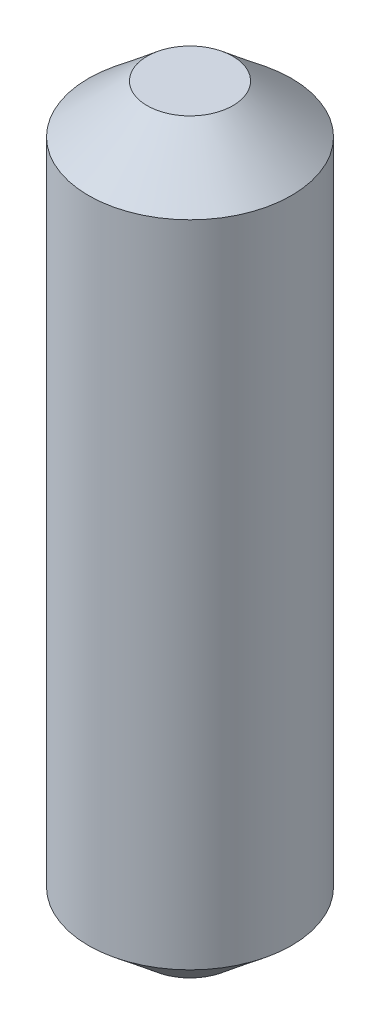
ISO-10303-21;
HEADER;
FILE_DESCRIPTION(('STEP AP214'),'2;1');
FILE_NAME('part.step','',(''),(''),'','','');
FILE_SCHEMA(('AUTOMOTIVE_DESIGN { 1 0 10303 214 1 1 1 1 }'));
ENDSEC;
DATA;
#1=APPLICATION_CONTEXT('core data for automotive mechanical design processes');
#2=APPLICATION_PROTOCOL_DEFINITION('international standard','automotive_design',2000,#1);
#3=PRODUCT_CONTEXT('',#1,'mechanical');
#4=PRODUCT('Part','Part','',(#3));
#5=PRODUCT_RELATED_PRODUCT_CATEGORY('part','',(#4));
#6=PRODUCT_DEFINITION_FORMATION('','',#4);
#7=PRODUCT_DEFINITION_CONTEXT('part definition',#1,'design');
#8=PRODUCT_DEFINITION('design','',#6,#7);
#9=PRODUCT_DEFINITION_SHAPE('','',#8);
#10=(LENGTH_UNIT() NAMED_UNIT(*) SI_UNIT(.MILLI.,.METRE.));
#11=(NAMED_UNIT(*) PLANE_ANGLE_UNIT() SI_UNIT($,.RADIAN.));
#12=(NAMED_UNIT(*) SI_UNIT($,.STERADIAN.) SOLID_ANGLE_UNIT());
#13=UNCERTAINTY_MEASURE_WITH_UNIT(LENGTH_MEASURE(1.E-05),#10,'distance_accuracy_value','');
#14=(GEOMETRIC_REPRESENTATION_CONTEXT(3) GLOBAL_UNCERTAINTY_ASSIGNED_CONTEXT((#13)) GLOBAL_UNIT_ASSIGNED_CONTEXT((#10,
#11,#12)) REPRESENTATION_CONTEXT('',''));
#15=CARTESIAN_POINT('',(0.,0.,0.));
#16=DIRECTION('',(0.,0.,1.));
#17=DIRECTION('',(1.,0.,0.));
#18=AXIS2_PLACEMENT_3D('',#15,#16,#17);
#19=CARTESIAN_POINT('',(0.,0.,0.));
#20=DIRECTION('',(0.,-1.,0.));
#21=DIRECTION('',(0.,0.,-1.));
#22=AXIS2_PLACEMENT_3D('',#19,#20,#21);
#23=PLANE('',#22);
#24=CARTESIAN_POINT('',(0.,0.,0.));
#25=DIRECTION('',(0.,-1.,0.));
#26=DIRECTION('',(0.,0.,-1.));
#27=AXIS2_PLACEMENT_3D('',#24,#25,#26);
#28=CIRCLE('',#27,0.482600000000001);
#29=CARTESIAN_POINT('',(0.,0.,-0.482600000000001));
#30=VERTEX_POINT('',#29);
#31=EDGE_CURVE('E10',#30,#30,#28,.T.);
#32=ORIENTED_EDGE('',*,*,#31,.T.);
#33=EDGE_LOOP('',(#32));
#34=FACE_BOUND('',#33,.T.);
#35=ADVANCED_FACE('F36',(#34),#23,.T.);
#36=CARTESIAN_POINT('',(0.,0.,0.));
#37=DIRECTION('',(0.,1.,0.));
#38=DIRECTION('',(0.,0.,1.));
#39=AXIS2_PLACEMENT_3D('',#36,#37,#38);
#40=CONICAL_SURFACE('',#39,0.482600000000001,0.879853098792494);
#41=CARTESIAN_POINT('',(0.,0.546100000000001,0.));
#42=DIRECTION('',(0.,-1.,0.));
#43=DIRECTION('',(0.,0.,-1.));
#44=AXIS2_PLACEMENT_3D('',#41,#42,#43);
#45=CIRCLE('',#44,1.143);
#46=CARTESIAN_POINT('',(0.,0.546100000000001,-1.143));
#47=VERTEX_POINT('',#46);
#48=EDGE_CURVE('E43',#47,#47,#45,.T.);
#49=ORIENTED_EDGE('',*,*,#48,.T.);
#50=EDGE_LOOP('',(#49));
#51=FACE_BOUND('',#50,.T.);
#52=ORIENTED_EDGE('',*,*,#31,.F.);
#53=EDGE_LOOP('',(#52));
#54=FACE_BOUND('',#53,.T.);
#55=ADVANCED_FACE('F71',(#51,#54),#40,.T.);
#56=CARTESIAN_POINT('',(0.,0.,0.));
#57=DIRECTION('',(0.,-1.,0.));
#58=DIRECTION('',(0.,0.,-1.));
#59=AXIS2_PLACEMENT_3D('',#56,#57,#58);
#60=CYLINDRICAL_SURFACE('',#59,1.143);
#61=CARTESIAN_POINT('',(0.,7.8613,0.));
#62=DIRECTION('',(0.,-1.,0.));
#63=DIRECTION('',(0.,0.,-1.));
#64=AXIS2_PLACEMENT_3D('',#61,#62,#63);
#65=CIRCLE('',#64,1.143);
#66=CARTESIAN_POINT('',(0.,7.8613,-1.143));
#67=VERTEX_POINT('',#66);
#68=EDGE_CURVE('E49',#67,#67,#65,.T.);
#69=ORIENTED_EDGE('',*,*,#68,.T.);
#70=EDGE_LOOP('',(#69));
#71=FACE_BOUND('',#70,.T.);
#72=ORIENTED_EDGE('',*,*,#48,.F.);
#73=EDGE_LOOP('',(#72));
#74=FACE_BOUND('',#73,.T.);
#75=ADVANCED_FACE('F68',(#71,#74),#60,.T.);
#76=CARTESIAN_POINT('',(0.,7.8613,0.));
#77=DIRECTION('',(0.,-1.,0.));
#78=DIRECTION('',(0.,0.,-1.));
#79=AXIS2_PLACEMENT_3D('',#76,#77,#78);
#80=CONICAL_SURFACE('',#79,1.143,0.879853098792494);
#81=CARTESIAN_POINT('',(0.,8.4074,0.));
#82=DIRECTION('',(0.,-1.,0.));
#83=DIRECTION('',(0.,0.,-1.));
#84=AXIS2_PLACEMENT_3D('',#81,#82,#83);
#85=CIRCLE('',#84,0.4826);
#86=CARTESIAN_POINT('',(0.,8.4074,-0.4826));
#87=VERTEX_POINT('',#86);
#88=EDGE_CURVE('E53',#87,#87,#85,.T.);
#89=ORIENTED_EDGE('',*,*,#88,.T.);
#90=EDGE_LOOP('',(#89));
#91=FACE_BOUND('',#90,.T.);
#92=ORIENTED_EDGE('',*,*,#68,.F.);
#93=EDGE_LOOP('',(#92));
#94=FACE_BOUND('',#93,.T.);
#95=ADVANCED_FACE('F59',(#91,#94),#80,.T.);
#96=CARTESIAN_POINT('',(0.4826,8.4074,0.));
#97=DIRECTION('',(0.,1.,0.));
#98=DIRECTION('',(0.,0.,1.));
#99=AXIS2_PLACEMENT_3D('',#96,#97,#98);
#100=PLANE('',#99);
#101=ORIENTED_EDGE('',*,*,#88,.F.);
#102=EDGE_LOOP('',(#101));
#103=FACE_BOUND('',#102,.T.);
#104=ADVANCED_FACE('F62',(#103),#100,.T.);
#105=CLOSED_SHELL('',(#35,#55,#75,#95,#104));
#106=MANIFOLD_SOLID_BREP('B2',#105);
#107=ADVANCED_BREP_SHAPE_REPRESENTATION('',(#18,#106),#14);
#108=SHAPE_DEFINITION_REPRESENTATION(#9,#107);
ENDSEC;
END-ISO-10303-21;
